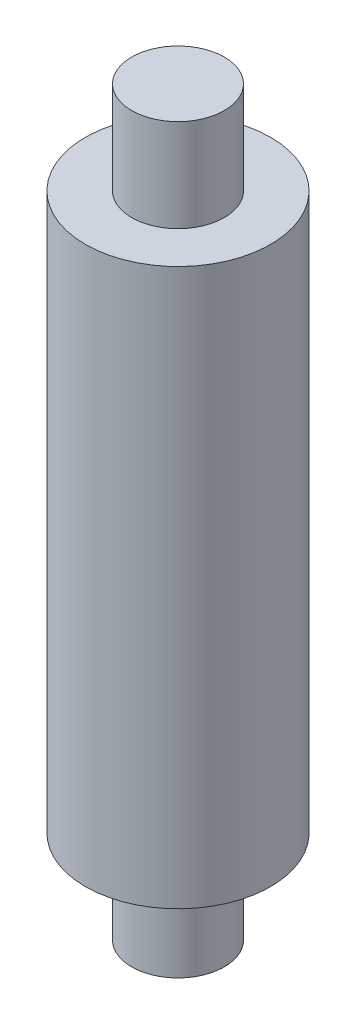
ISO-10303-21;
HEADER;
FILE_DESCRIPTION(('STEP AP214'),'2;1');
FILE_NAME('part.step','',(''),(''),'','','');
FILE_SCHEMA(('AUTOMOTIVE_DESIGN { 1 0 10303 214 1 1 1 1 }'));
ENDSEC;
DATA;
#1=APPLICATION_CONTEXT('core data for automotive mechanical design processes');
#2=APPLICATION_PROTOCOL_DEFINITION('international standard','automotive_design',2000,#1);
#3=PRODUCT_CONTEXT('',#1,'mechanical');
#4=PRODUCT('Part','Part','',(#3));
#5=PRODUCT_RELATED_PRODUCT_CATEGORY('part','',(#4));
#6=PRODUCT_DEFINITION_FORMATION('','',#4);
#7=PRODUCT_DEFINITION_CONTEXT('part definition',#1,'design');
#8=PRODUCT_DEFINITION('design','',#6,#7);
#9=PRODUCT_DEFINITION_SHAPE('','',#8);
#10=(LENGTH_UNIT() NAMED_UNIT(*) SI_UNIT(.MILLI.,.METRE.));
#11=(NAMED_UNIT(*) PLANE_ANGLE_UNIT() SI_UNIT($,.RADIAN.));
#12=(NAMED_UNIT(*) SI_UNIT($,.STERADIAN.) SOLID_ANGLE_UNIT());
#13=UNCERTAINTY_MEASURE_WITH_UNIT(LENGTH_MEASURE(1.E-05),#10,'distance_accuracy_value','');
#14=(GEOMETRIC_REPRESENTATION_CONTEXT(3) GLOBAL_UNCERTAINTY_ASSIGNED_CONTEXT((#13)) GLOBAL_UNIT_ASSIGNED_CONTEXT((#10,
#11,#12)) REPRESENTATION_CONTEXT('',''));
#15=CARTESIAN_POINT('',(0.,0.,0.));
#16=DIRECTION('',(0.,0.,1.));
#17=DIRECTION('',(1.,0.,0.));
#18=AXIS2_PLACEMENT_3D('',#15,#16,#17);
#19=CARTESIAN_POINT('',(0.,800.,0.));
#20=DIRECTION('',(0.,1.,0.));
#21=DIRECTION('',(0.,0.,1.));
#22=AXIS2_PLACEMENT_3D('',#19,#20,#21);
#23=PLANE('',#22);
#24=CARTESIAN_POINT('',(0.,800.,0.));
#25=DIRECTION('',(0.,-1.,0.));
#26=DIRECTION('',(0.,0.,-1.));
#27=AXIS2_PLACEMENT_3D('',#24,#25,#26);
#28=CIRCLE('',#27,50.);
#29=CARTESIAN_POINT('',(0.,800.,-50.));
#30=VERTEX_POINT('',#29);
#31=EDGE_CURVE('E10',#30,#30,#28,.T.);
#32=ORIENTED_EDGE('',*,*,#31,.F.);
#33=EDGE_LOOP('',(#32));
#34=FACE_BOUND('',#33,.T.);
#35=ADVANCED_FACE('F34',(#34),#23,.T.);
#36=CARTESIAN_POINT('',(0.,0.,0.));
#37=DIRECTION('',(0.,-1.,0.));
#38=DIRECTION('',(0.,0.,-1.));
#39=AXIS2_PLACEMENT_3D('',#36,#37,#38);
#40=CYLINDRICAL_SURFACE('',#39,50.);
#41=ORIENTED_EDGE('',*,*,#31,.T.);
#42=EDGE_LOOP('',(#41));
#43=FACE_BOUND('',#42,.T.);
#44=CARTESIAN_POINT('',(0.,700.,0.));
#45=DIRECTION('',(0.,-1.,0.));
#46=DIRECTION('',(0.,0.,-1.));
#47=AXIS2_PLACEMENT_3D('',#44,#45,#46);
#48=CIRCLE('',#47,50.);
#49=CARTESIAN_POINT('',(0.,700.,-50.));
#50=VERTEX_POINT('',#49);
#51=EDGE_CURVE('E40',#50,#50,#48,.T.);
#52=ORIENTED_EDGE('',*,*,#51,.F.);
#53=EDGE_LOOP('',(#52));
#54=FACE_BOUND('',#53,.T.);
#55=ADVANCED_FACE('F76',(#43,#54),#40,.T.);
#56=CARTESIAN_POINT('',(50.,700.,0.));
#57=DIRECTION('',(0.,1.,0.));
#58=DIRECTION('',(0.,0.,1.));
#59=AXIS2_PLACEMENT_3D('',#56,#57,#58);
#60=PLANE('',#59);
#61=ORIENTED_EDGE('',*,*,#51,.T.);
#62=EDGE_LOOP('',(#61));
#63=FACE_BOUND('',#62,.T.);
#64=CARTESIAN_POINT('',(0.,700.,0.));
#65=DIRECTION('',(0.,-1.,0.));
#66=DIRECTION('',(0.,0.,-1.));
#67=AXIS2_PLACEMENT_3D('',#64,#65,#66);
#68=CIRCLE('',#67,100.);
#69=CARTESIAN_POINT('',(0.,700.,-100.));
#70=VERTEX_POINT('',#69);
#71=EDGE_CURVE('E44',#70,#70,#68,.T.);
#72=ORIENTED_EDGE('',*,*,#71,.F.);
#73=EDGE_LOOP('',(#72));
#74=FACE_BOUND('',#73,.T.);
#75=ADVANCED_FACE('F81',(#63,#74),#60,.T.);
#76=CARTESIAN_POINT('',(0.,0.,0.));
#77=DIRECTION('',(0.,-1.,0.));
#78=DIRECTION('',(0.,0.,-1.));
#79=AXIS2_PLACEMENT_3D('',#76,#77,#78);
#80=CYLINDRICAL_SURFACE('',#79,100.);
#81=ORIENTED_EDGE('',*,*,#71,.T.);
#82=EDGE_LOOP('',(#81));
#83=FACE_BOUND('',#82,.T.);
#84=CARTESIAN_POINT('',(0.,100.,0.));
#85=DIRECTION('',(0.,-1.,0.));
#86=DIRECTION('',(0.,0.,-1.));
#87=AXIS2_PLACEMENT_3D('',#84,#85,#86);
#88=CIRCLE('',#87,100.);
#89=CARTESIAN_POINT('',(0.,100.,-100.));
#90=VERTEX_POINT('',#89);
#91=EDGE_CURVE('E48',#90,#90,#88,.T.);
#92=ORIENTED_EDGE('',*,*,#91,.F.);
#93=EDGE_LOOP('',(#92));
#94=FACE_BOUND('',#93,.T.);
#95=ADVANCED_FACE('F72',(#83,#94),#80,.T.);
#96=CARTESIAN_POINT('',(100.,100.,0.));
#97=DIRECTION('',(0.,-1.,0.));
#98=DIRECTION('',(0.,0.,-1.));
#99=AXIS2_PLACEMENT_3D('',#96,#97,#98);
#100=PLANE('',#99);
#101=ORIENTED_EDGE('',*,*,#91,.T.);
#102=EDGE_LOOP('',(#101));
#103=FACE_BOUND('',#102,.T.);
#104=CARTESIAN_POINT('',(0.,100.,0.));
#105=DIRECTION('',(0.,-1.,0.));
#106=DIRECTION('',(0.,0.,-1.));
#107=AXIS2_PLACEMENT_3D('',#104,#105,#106);
#108=CIRCLE('',#107,50.0000000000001);
#109=CARTESIAN_POINT('',(0.,100.,-50.0000000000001));
#110=VERTEX_POINT('',#109);
#111=EDGE_CURVE('E53',#110,#110,#108,.T.);
#112=ORIENTED_EDGE('',*,*,#111,.F.);
#113=EDGE_LOOP('',(#112));
#114=FACE_BOUND('',#113,.T.);
#115=ADVANCED_FACE('F64',(#103,#114),#100,.T.);
#116=CARTESIAN_POINT('',(0.,0.,0.));
#117=DIRECTION('',(0.,-1.,0.));
#118=DIRECTION('',(0.,0.,-1.));
#119=AXIS2_PLACEMENT_3D('',#116,#117,#118);
#120=CYLINDRICAL_SURFACE('',#119,50.0000000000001);
#121=ORIENTED_EDGE('',*,*,#111,.T.);
#122=EDGE_LOOP('',(#121));
#123=FACE_BOUND('',#122,.T.);
#124=CARTESIAN_POINT('',(0.,0.,0.));
#125=DIRECTION('',(0.,-1.,0.));
#126=DIRECTION('',(0.,0.,-1.));
#127=AXIS2_PLACEMENT_3D('',#124,#125,#126);
#128=CIRCLE('',#127,50.0000000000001);
#129=CARTESIAN_POINT('',(0.,0.,-50.0000000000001));
#130=VERTEX_POINT('',#129);
#131=EDGE_CURVE('E56',#130,#130,#128,.T.);
#132=ORIENTED_EDGE('',*,*,#131,.F.);
#133=EDGE_LOOP('',(#132));
#134=FACE_BOUND('',#133,.T.);
#135=ADVANCED_FACE('F62',(#123,#134),#120,.T.);
#136=CARTESIAN_POINT('',(50.0000000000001,0.,0.));
#137=DIRECTION('',(0.,-1.,0.));
#138=DIRECTION('',(0.,0.,-1.));
#139=AXIS2_PLACEMENT_3D('',#136,#137,#138);
#140=PLANE('',#139);
#141=ORIENTED_EDGE('',*,*,#131,.T.);
#142=EDGE_LOOP('',(#141));
#143=FACE_BOUND('',#142,.T.);
#144=ADVANCED_FACE('F60',(#143),#140,.T.);
#145=CLOSED_SHELL('',(#35,#55,#75,#95,#115,#135,#144));
#146=MANIFOLD_SOLID_BREP('B2',#145);
#147=ADVANCED_BREP_SHAPE_REPRESENTATION('',(#18,#146),#14);
#148=SHAPE_DEFINITION_REPRESENTATION(#9,#147);
ENDSEC;
END-ISO-10303-21;
